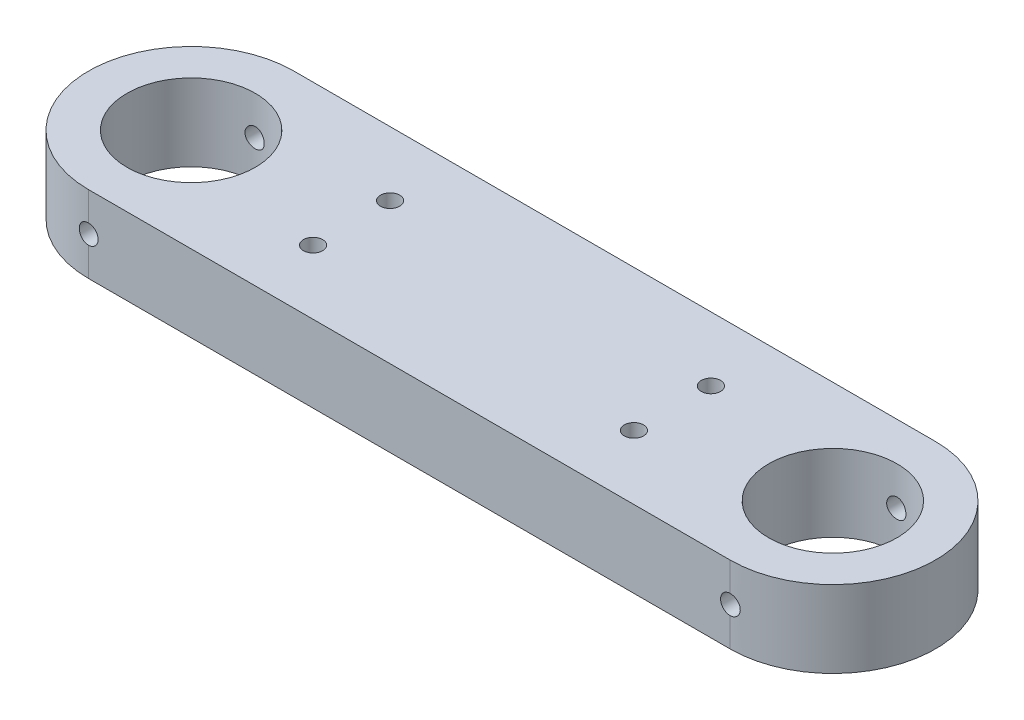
from build123d import *

# Parameters (mm, degrees)
SKETCH1_R          = 31.75
SKETCH1_R_2        = 4.7625
EXTRUDE1_DEPTH     = 38.1
SKETCH2_R          = 4.7625
CUT_EXTRUDE1_DEPTH = 52.07


with BuildPart() as part:
    # Sketch1 → Extrude1 (new body)
    with BuildSketch(Plane(origin=(0, 0, 0), x_dir=(1, 0, 0), z_dir=(0, 1, 0))):
        with BuildLine():
            Line((-158.75, 50.8), (158.75, 50.8))
            ThreePointArc((158.75, 50.8), (209.55, 0), (158.75, -50.8))
            Line((158.75, -50.8), (-158.75, -50.8))
            ThreePointArc((-158.75, -50.8), (-209.55, 0), (-158.75, 50.8))
        make_face()
        with Locations(Location((-158.75, 0, 0), (0, 0, 270))):
            Circle(SKETCH1_R, mode=Mode.SUBTRACT)
        with Locations(Location((158.75, 0, 0), (0, 0, 270))):
            Circle(SKETCH1_R, mode=Mode.SUBTRACT)
        with Locations(Location((-79.375, 19.05, 0), (0, 0, 270))):
            Circle(SKETCH1_R_2, mode=Mode.SUBTRACT)
        with Locations(Location((79.375, 19.05, 0), (0, 0, 270))):
            Circle(SKETCH1_R_2, mode=Mode.SUBTRACT)
        with Locations(Location((-79.375, -19.05, 0), (0, 0, 270))):
            Circle(SKETCH1_R_2, mode=Mode.SUBTRACT)
        with Locations(Location((79.375, -19.05, 0), (0, 0, 270))):
            Circle(SKETCH1_R_2, mode=Mode.SUBTRACT)
    extrude(amount=-EXTRUDE1_DEPTH)

    # Sketch2 → Cut-Extrude1 (cut, symmetric)
    with BuildSketch(Plane.XY):
        with Locations((-158.75, -19.05)):
            Circle(SKETCH2_R)
    cut_extrude1 = extrude(amount=CUT_EXTRUDE1_DEPTH, both=True, mode=Mode.SUBTRACT)

    # Mirror1: Cut-Extrude1 across plane
    add(cut_extrude1.mirror(Plane(origin=(0, 0, 0), x_dir=(0, 0, 1), z_dir=(1, 0, 0))), mode=Mode.SUBTRACT)


solid = part.part
